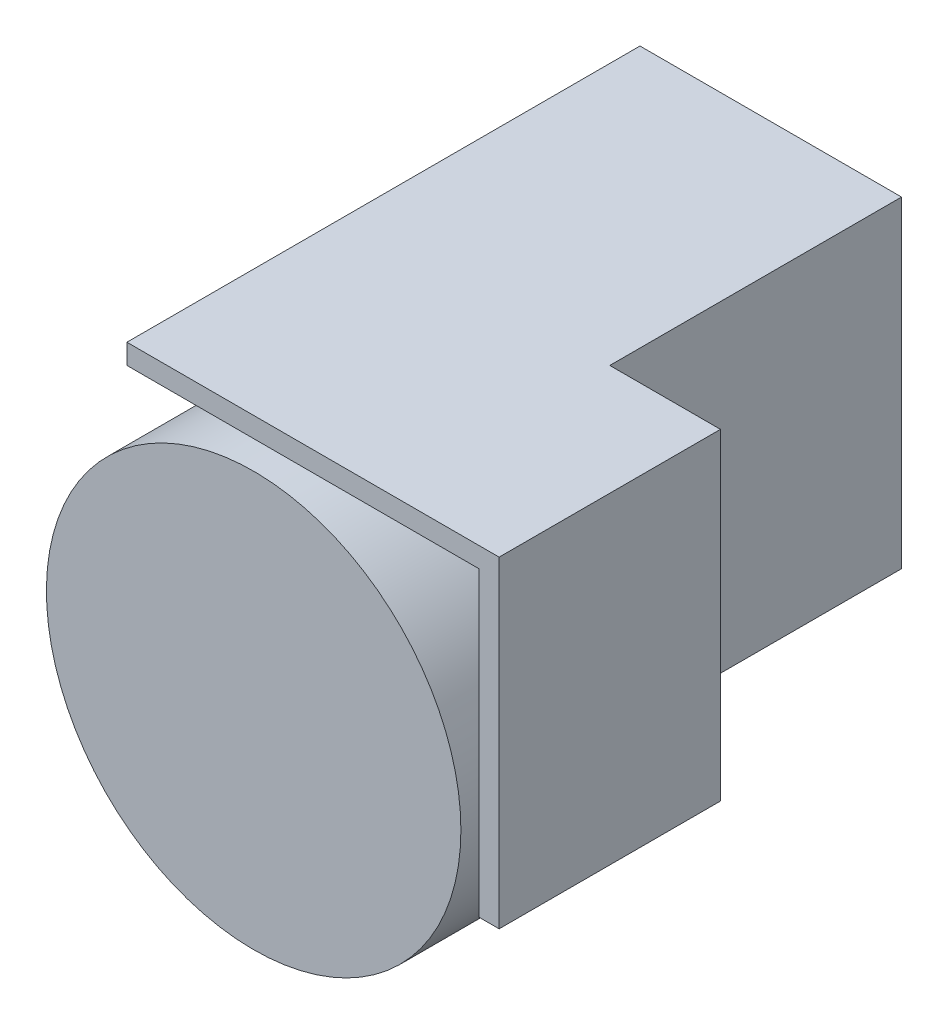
ISO-10303-21;
HEADER;
FILE_DESCRIPTION(('STEP AP214'),'2;1');
FILE_NAME('part.step','',(''),(''),'','','');
FILE_SCHEMA(('AUTOMOTIVE_DESIGN { 1 0 10303 214 1 1 1 1 }'));
ENDSEC;
DATA;
#1=APPLICATION_CONTEXT('core data for automotive mechanical design processes');
#2=APPLICATION_PROTOCOL_DEFINITION('international standard','automotive_design',2000,#1);
#3=PRODUCT_CONTEXT('',#1,'mechanical');
#4=PRODUCT('Part','Part','',(#3));
#5=PRODUCT_RELATED_PRODUCT_CATEGORY('part','',(#4));
#6=PRODUCT_DEFINITION_FORMATION('','',#4);
#7=PRODUCT_DEFINITION_CONTEXT('part definition',#1,'design');
#8=PRODUCT_DEFINITION('design','',#6,#7);
#9=PRODUCT_DEFINITION_SHAPE('','',#8);
#10=(LENGTH_UNIT() NAMED_UNIT(*) SI_UNIT(.MILLI.,.METRE.));
#11=(NAMED_UNIT(*) PLANE_ANGLE_UNIT() SI_UNIT($,.RADIAN.));
#12=(NAMED_UNIT(*) SI_UNIT($,.STERADIAN.) SOLID_ANGLE_UNIT());
#13=UNCERTAINTY_MEASURE_WITH_UNIT(LENGTH_MEASURE(1.E-05),#10,'distance_accuracy_value','');
#14=(GEOMETRIC_REPRESENTATION_CONTEXT(3) GLOBAL_UNCERTAINTY_ASSIGNED_CONTEXT((#13)) GLOBAL_UNIT_ASSIGNED_CONTEXT((#10,
#11,#12)) REPRESENTATION_CONTEXT('',''));
#15=CARTESIAN_POINT('',(0.,0.,0.));
#16=DIRECTION('',(0.,0.,1.));
#17=DIRECTION('',(1.,0.,0.));
#18=AXIS2_PLACEMENT_3D('',#15,#16,#17);
#19=CARTESIAN_POINT('',(-11.090622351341,0.,30.));
#20=DIRECTION('',(-1.,0.,0.));
#21=DIRECTION('',(0.,0.,1.));
#22=AXIS2_PLACEMENT_3D('',#19,#20,#21);
#23=PLANE('',#22);
#24=DIRECTION('',(0.,1.,0.));
#25=VECTOR('',#24,1.);
#26=CARTESIAN_POINT('',(-11.090622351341,0.,0.));
#27=LINE('',#26,#25);
#28=CARTESIAN_POINT('',(-11.090622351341,0.,0.));
#29=VERTEX_POINT('',#28);
#30=CARTESIAN_POINT('',(-11.090622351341,32.,0.));
#31=VERTEX_POINT('',#30);
#32=EDGE_CURVE('E191',#29,#31,#27,.T.);
#33=ORIENTED_EDGE('',*,*,#32,.F.);
#34=DIRECTION('',(0.,0.,-1.));
#35=VECTOR('',#34,1.);
#36=CARTESIAN_POINT('',(-11.090622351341,0.,30.));
#37=LINE('',#36,#35);
#38=CARTESIAN_POINT('',(-11.090622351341,0.,30.));
#39=VERTEX_POINT('',#38);
#40=EDGE_CURVE('E11',#39,#29,#37,.T.);
#41=ORIENTED_EDGE('',*,*,#40,.F.);
#42=DIRECTION('',(0.,1.,0.));
#43=VECTOR('',#42,1.);
#44=CARTESIAN_POINT('',(-11.090622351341,0.,30.));
#45=LINE('',#44,#43);
#46=CARTESIAN_POINT('',(-11.090622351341,22.9799874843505,30.));
#47=VERTEX_POINT('',#46);
#48=EDGE_CURVE('E192',#39,#47,#45,.T.);
#49=ORIENTED_EDGE('',*,*,#48,.T.);
#50=CARTESIAN_POINT('',(-11.090622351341,30.,30.));
#51=VERTEX_POINT('',#50);
#52=EDGE_CURVE('E195',#47,#51,#45,.T.);
#53=ORIENTED_EDGE('',*,*,#52,.T.);
#54=DIRECTION('',(0.,0.,-1.));
#55=VECTOR('',#54,1.);
#56=CARTESIAN_POINT('',(-11.090622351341,30.,51.));
#57=LINE('',#56,#55);
#58=CARTESIAN_POINT('',(-11.090622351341,30.,51.));
#59=VERTEX_POINT('',#58);
#60=EDGE_CURVE('E174',#59,#51,#57,.T.);
#61=ORIENTED_EDGE('',*,*,#60,.F.);
#62=DIRECTION('',(0.,1.,0.));
#63=VECTOR('',#62,1.);
#64=CARTESIAN_POINT('',(-11.090622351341,30.,51.));
#65=LINE('',#64,#63);
#66=CARTESIAN_POINT('',(-11.090622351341,32.,51.));
#67=VERTEX_POINT('',#66);
#68=EDGE_CURVE('E171',#59,#67,#65,.T.);
#69=ORIENTED_EDGE('',*,*,#68,.T.);
#70=DIRECTION('',(0.,0.,-1.));
#71=VECTOR('',#70,1.);
#72=CARTESIAN_POINT('',(-11.090622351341,32.,51.));
#73=LINE('',#72,#71);
#74=EDGE_CURVE('E178',#67,#31,#73,.T.);
#75=ORIENTED_EDGE('',*,*,#74,.T.);
#76=EDGE_LOOP('',(#33,#41,#49,#53,#61,#69,#75));
#77=FACE_BOUND('',#76,.T.);
#78=ADVANCED_FACE('F38',(#77),#23,.T.);
#79=CARTESIAN_POINT('',(-11.090622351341,0.,30.));
#80=DIRECTION('',(0.,1.,0.));
#81=DIRECTION('',(0.,0.,1.));
#82=AXIS2_PLACEMENT_3D('',#79,#80,#81);
#83=PLANE('',#82);
#84=DIRECTION('',(1.,0.,0.));
#85=VECTOR('',#84,1.);
#86=CARTESIAN_POINT('',(-11.090622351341,0.,0.));
#87=LINE('',#86,#85);
#88=CARTESIAN_POINT('',(14.909377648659,0.,0.));
#89=VERTEX_POINT('',#88);
#90=EDGE_CURVE('E207',#29,#89,#87,.T.);
#91=ORIENTED_EDGE('',*,*,#90,.T.);
#92=DIRECTION('',(0.,0.,-1.));
#93=VECTOR('',#92,1.);
#94=CARTESIAN_POINT('',(14.909377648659,0.,30.));
#95=LINE('',#94,#93);
#96=CARTESIAN_POINT('',(14.909377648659,0.,30.));
#97=VERTEX_POINT('',#96);
#98=EDGE_CURVE('E46',#97,#89,#95,.T.);
#99=ORIENTED_EDGE('',*,*,#98,.F.);
#100=DIRECTION('',(1.,0.,0.));
#101=VECTOR('',#100,1.);
#102=CARTESIAN_POINT('',(-11.090622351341,0.,30.));
#103=LINE('',#102,#101);
#104=EDGE_CURVE('E202',#39,#97,#103,.T.);
#105=ORIENTED_EDGE('',*,*,#104,.F.);
#106=ORIENTED_EDGE('',*,*,#40,.T.);
#107=EDGE_LOOP('',(#91,#99,#105,#106));
#108=FACE_BOUND('',#107,.T.);
#109=ADVANCED_FACE('F238',(#108),#83,.F.);
#110=CARTESIAN_POINT('',(14.909377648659,0.,30.));
#111=DIRECTION('',(-1.,0.,0.));
#112=DIRECTION('',(0.,-1.,0.));
#113=AXIS2_PLACEMENT_3D('',#110,#111,#112);
#114=PLANE('',#113);
#115=ORIENTED_EDGE('',*,*,#98,.T.);
#116=DIRECTION('',(0.,1.,0.));
#117=VECTOR('',#116,1.);
#118=CARTESIAN_POINT('',(14.909377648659,0.,0.));
#119=LINE('',#118,#117);
#120=CARTESIAN_POINT('',(14.909377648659,32.,0.));
#121=VERTEX_POINT('',#120);
#122=EDGE_CURVE('E54',#89,#121,#119,.T.);
#123=ORIENTED_EDGE('',*,*,#122,.T.);
#124=DIRECTION('',(0.,0.,1.));
#125=VECTOR('',#124,1.);
#126=CARTESIAN_POINT('',(14.909377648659,32.,0.));
#127=LINE('',#126,#125);
#128=CARTESIAN_POINT('',(14.9093776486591,32.,29.));
#129=VERTEX_POINT('',#128);
#130=EDGE_CURVE('E133',#121,#129,#127,.T.);
#131=ORIENTED_EDGE('',*,*,#130,.T.);
#132=DIRECTION('',(0.,1.,0.));
#133=VECTOR('',#132,1.);
#134=CARTESIAN_POINT('',(14.9093776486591,-13.6,29.));
#135=LINE('',#134,#133);
#136=CARTESIAN_POINT('',(14.9093776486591,30.,29.));
#137=VERTEX_POINT('',#136);
#138=EDGE_CURVE('E122',#137,#129,#135,.T.);
#139=ORIENTED_EDGE('',*,*,#138,.F.);
#140=DIRECTION('',(0.,0.,-1.));
#141=VECTOR('',#140,1.);
#142=CARTESIAN_POINT('',(14.909377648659,30.,30.));
#143=LINE('',#142,#141);
#144=CARTESIAN_POINT('',(14.909377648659,30.,30.));
#145=VERTEX_POINT('',#144);
#146=EDGE_CURVE('E41',#145,#137,#143,.T.);
#147=ORIENTED_EDGE('',*,*,#146,.F.);
#148=DIRECTION('',(0.,1.,0.));
#149=VECTOR('',#148,1.);
#150=CARTESIAN_POINT('',(14.909377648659,0.,30.));
#151=LINE('',#150,#149);
#152=CARTESIAN_POINT('',(14.909377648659,22.9799874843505,30.));
#153=VERTEX_POINT('',#152);
#154=EDGE_CURVE('E198',#153,#145,#151,.T.);
#155=ORIENTED_EDGE('',*,*,#154,.F.);
#156=EDGE_CURVE('E199',#97,#153,#151,.T.);
#157=ORIENTED_EDGE('',*,*,#156,.F.);
#158=EDGE_LOOP('',(#115,#123,#131,#139,#147,#155,#157));
#159=FACE_BOUND('',#158,.T.);
#160=ADVANCED_FACE('F134',(#159),#114,.F.);
#161=CARTESIAN_POINT('',(0.,0.,30.));
#162=DIRECTION('',(0.,0.,-1.));
#163=DIRECTION('',(-1.,0.,0.));
#164=AXIS2_PLACEMENT_3D('',#161,#162,#163);
#165=PLANE('',#164);
#166=CARTESIAN_POINT('',(1.90937764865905,7.,30.));
#167=DIRECTION('',(0.,0.,1.));
#168=DIRECTION('',(1.,0.,0.));
#169=AXIS2_PLACEMENT_3D('',#166,#167,#168);
#170=CIRCLE('',#169,20.6);
#171=EDGE_CURVE('E62',#153,#47,#170,.T.);
#172=ORIENTED_EDGE('',*,*,#171,.F.);
#173=ORIENTED_EDGE('',*,*,#154,.T.);
#174=DIRECTION('',(1.,0.,0.));
#175=VECTOR('',#174,1.);
#176=CARTESIAN_POINT('',(-11.090622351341,30.,30.));
#177=LINE('',#176,#175);
#178=EDGE_CURVE('E194',#51,#145,#177,.T.);
#179=ORIENTED_EDGE('',*,*,#178,.F.);
#180=ORIENTED_EDGE('',*,*,#52,.F.);
#181=EDGE_LOOP('',(#172,#173,#179,#180));
#182=FACE_BOUND('',#181,.T.);
#183=ADVANCED_FACE('F250',(#182),#165,.F.);
#184=CARTESIAN_POINT('',(0.,0.,0.));
#185=DIRECTION('',(0.,0.,-1.));
#186=DIRECTION('',(-1.,0.,0.));
#187=AXIS2_PLACEMENT_3D('',#184,#185,#186);
#188=PLANE('',#187);
#189=DIRECTION('',(1.,0.,0.));
#190=VECTOR('',#189,1.);
#191=CARTESIAN_POINT('',(-11.090622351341,32.,0.));
#192=LINE('',#191,#190);
#193=EDGE_CURVE('E157',#31,#121,#192,.T.);
#194=ORIENTED_EDGE('',*,*,#193,.T.);
#195=ORIENTED_EDGE('',*,*,#122,.F.);
#196=ORIENTED_EDGE('',*,*,#90,.F.);
#197=ORIENTED_EDGE('',*,*,#32,.T.);
#198=EDGE_LOOP('',(#194,#195,#196,#197));
#199=FACE_BOUND('',#198,.T.);
#200=ADVANCED_FACE('F249',(#199),#188,.T.);
#201=CARTESIAN_POINT('',(-11.090622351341,30.,51.));
#202=DIRECTION('',(0.,1.,0.));
#203=DIRECTION('',(0.,0.,1.));
#204=AXIS2_PLACEMENT_3D('',#201,#202,#203);
#205=PLANE('',#204);
#206=ORIENTED_EDGE('',*,*,#146,.T.);
#207=DIRECTION('',(1.,0.,0.));
#208=VECTOR('',#207,1.);
#209=CARTESIAN_POINT('',(-11.090622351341,30.,29.));
#210=LINE('',#209,#208);
#211=CARTESIAN_POINT('',(23.909377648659,30.,29.));
#212=VERTEX_POINT('',#211);
#213=EDGE_CURVE('E128',#137,#212,#210,.T.);
#214=ORIENTED_EDGE('',*,*,#213,.T.);
#215=DIRECTION('',(0.,0.,-1.));
#216=VECTOR('',#215,1.);
#217=CARTESIAN_POINT('',(23.909377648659,30.,51.));
#218=LINE('',#217,#216);
#219=CARTESIAN_POINT('',(23.909377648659,30.,51.));
#220=VERTEX_POINT('',#219);
#221=EDGE_CURVE('E188',#220,#212,#218,.T.);
#222=ORIENTED_EDGE('',*,*,#221,.F.);
#223=DIRECTION('',(1.,0.,0.));
#224=VECTOR('',#223,1.);
#225=CARTESIAN_POINT('',(-11.090622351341,30.,51.));
#226=LINE('',#225,#224);
#227=EDGE_CURVE('E159',#59,#220,#226,.T.);
#228=ORIENTED_EDGE('',*,*,#227,.F.);
#229=ORIENTED_EDGE('',*,*,#60,.T.);
#230=ORIENTED_EDGE('',*,*,#178,.T.);
#231=EDGE_LOOP('',(#206,#214,#222,#228,#229,#230));
#232=FACE_BOUND('',#231,.T.);
#233=ADVANCED_FACE('F211',(#232),#205,.F.);
#234=CARTESIAN_POINT('',(23.909377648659,30.,51.));
#235=DIRECTION('',(1.,0.,0.));
#236=DIRECTION('',(0.,0.,-1.));
#237=AXIS2_PLACEMENT_3D('',#234,#235,#236);
#238=PLANE('',#237);
#239=ORIENTED_EDGE('',*,*,#221,.T.);
#240=DIRECTION('',(0.,-1.,0.));
#241=VECTOR('',#240,1.);
#242=CARTESIAN_POINT('',(23.909377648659,30.,29.));
#243=LINE('',#242,#241);
#244=CARTESIAN_POINT('',(23.909377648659,0.,29.));
#245=VERTEX_POINT('',#244);
#246=EDGE_CURVE('E149',#212,#245,#243,.T.);
#247=ORIENTED_EDGE('',*,*,#246,.T.);
#248=DIRECTION('',(0.,0.,-1.));
#249=VECTOR('',#248,1.);
#250=CARTESIAN_POINT('',(23.909377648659,0.,51.));
#251=LINE('',#250,#249);
#252=CARTESIAN_POINT('',(23.909377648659,0.,51.));
#253=VERTEX_POINT('',#252);
#254=EDGE_CURVE('E185',#253,#245,#251,.T.);
#255=ORIENTED_EDGE('',*,*,#254,.F.);
#256=DIRECTION('',(0.,-1.,0.));
#257=VECTOR('',#256,1.);
#258=CARTESIAN_POINT('',(23.909377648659,30.,51.));
#259=LINE('',#258,#257);
#260=EDGE_CURVE('E162',#220,#253,#259,.T.);
#261=ORIENTED_EDGE('',*,*,#260,.F.);
#262=EDGE_LOOP('',(#239,#247,#255,#261));
#263=FACE_BOUND('',#262,.T.);
#264=ADVANCED_FACE('F261',(#263),#238,.F.);
#265=CARTESIAN_POINT('',(23.909377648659,0.,51.));
#266=DIRECTION('',(0.,1.,0.));
#267=DIRECTION('',(-1.,0.,0.));
#268=AXIS2_PLACEMENT_3D('',#265,#266,#267);
#269=PLANE('',#268);
#270=ORIENTED_EDGE('',*,*,#254,.T.);
#271=DIRECTION('',(1.,0.,0.));
#272=VECTOR('',#271,1.);
#273=CARTESIAN_POINT('',(23.909377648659,0.,29.));
#274=LINE('',#273,#272);
#275=CARTESIAN_POINT('',(25.909377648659,0.,29.));
#276=VERTEX_POINT('',#275);
#277=EDGE_CURVE('E145',#245,#276,#274,.T.);
#278=ORIENTED_EDGE('',*,*,#277,.T.);
#279=DIRECTION('',(0.,0.,-1.));
#280=VECTOR('',#279,1.);
#281=CARTESIAN_POINT('',(25.909377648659,0.,51.));
#282=LINE('',#281,#280);
#283=CARTESIAN_POINT('',(25.909377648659,0.,51.));
#284=VERTEX_POINT('',#283);
#285=EDGE_CURVE('E182',#284,#276,#282,.T.);
#286=ORIENTED_EDGE('',*,*,#285,.F.);
#287=DIRECTION('',(1.,0.,0.));
#288=VECTOR('',#287,1.);
#289=CARTESIAN_POINT('',(23.909377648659,0.,51.));
#290=LINE('',#289,#288);
#291=EDGE_CURVE('E164',#253,#284,#290,.T.);
#292=ORIENTED_EDGE('',*,*,#291,.F.);
#293=EDGE_LOOP('',(#270,#278,#286,#292));
#294=FACE_BOUND('',#293,.T.);
#295=ADVANCED_FACE('F264',(#294),#269,.F.);
#296=CARTESIAN_POINT('',(25.909377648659,32.,51.));
#297=DIRECTION('',(1.,0.,0.));
#298=DIRECTION('',(0.,1.,0.));
#299=AXIS2_PLACEMENT_3D('',#296,#297,#298);
#300=PLANE('',#299);
#301=DIRECTION('',(0.,1.,0.));
#302=VECTOR('',#301,1.);
#303=CARTESIAN_POINT('',(25.909377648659,-13.6,29.));
#304=LINE('',#303,#302);
#305=CARTESIAN_POINT('',(25.909377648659,32.,29.));
#306=VERTEX_POINT('',#305);
#307=EDGE_CURVE('E131',#276,#306,#304,.T.);
#308=ORIENTED_EDGE('',*,*,#307,.T.);
#309=DIRECTION('',(0.,0.,-1.));
#310=VECTOR('',#309,1.);
#311=CARTESIAN_POINT('',(25.909377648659,32.,51.));
#312=LINE('',#311,#310);
#313=CARTESIAN_POINT('',(25.909377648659,32.,51.));
#314=VERTEX_POINT('',#313);
#315=EDGE_CURVE('E142',#314,#306,#312,.T.);
#316=ORIENTED_EDGE('',*,*,#315,.F.);
#317=DIRECTION('',(0.,-1.,0.));
#318=VECTOR('',#317,1.);
#319=CARTESIAN_POINT('',(25.909377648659,32.,51.));
#320=LINE('',#319,#318);
#321=EDGE_CURVE('E166',#314,#284,#320,.T.);
#322=ORIENTED_EDGE('',*,*,#321,.T.);
#323=ORIENTED_EDGE('',*,*,#285,.T.);
#324=EDGE_LOOP('',(#308,#316,#322,#323));
#325=FACE_BOUND('',#324,.T.);
#326=ADVANCED_FACE('F268',(#325),#300,.T.);
#327=CARTESIAN_POINT('',(-11.090622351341,32.,51.));
#328=DIRECTION('',(0.,1.,0.));
#329=DIRECTION('',(0.,0.,1.));
#330=AXIS2_PLACEMENT_3D('',#327,#328,#329);
#331=PLANE('',#330);
#332=DIRECTION('',(1.,0.,0.));
#333=VECTOR('',#332,1.);
#334=CARTESIAN_POINT('',(25.909377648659,32.,29.));
#335=LINE('',#334,#333);
#336=EDGE_CURVE('E125',#129,#306,#335,.T.);
#337=ORIENTED_EDGE('',*,*,#336,.F.);
#338=ORIENTED_EDGE('',*,*,#130,.F.);
#339=ORIENTED_EDGE('',*,*,#193,.F.);
#340=ORIENTED_EDGE('',*,*,#74,.F.);
#341=DIRECTION('',(1.,0.,0.));
#342=VECTOR('',#341,1.);
#343=CARTESIAN_POINT('',(23.909377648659,32.,51.));
#344=LINE('',#343,#342);
#345=EDGE_CURVE('E169',#67,#314,#344,.T.);
#346=ORIENTED_EDGE('',*,*,#345,.T.);
#347=ORIENTED_EDGE('',*,*,#315,.T.);
#348=EDGE_LOOP('',(#337,#338,#339,#340,#346,#347));
#349=FACE_BOUND('',#348,.T.);
#350=ADVANCED_FACE('F140',(#349),#331,.T.);
#351=CARTESIAN_POINT('',(0.,0.,51.));
#352=DIRECTION('',(0.,0.,-1.));
#353=DIRECTION('',(-1.,0.,0.));
#354=AXIS2_PLACEMENT_3D('',#351,#352,#353);
#355=PLANE('',#354);
#356=ORIENTED_EDGE('',*,*,#227,.T.);
#357=ORIENTED_EDGE('',*,*,#260,.T.);
#358=ORIENTED_EDGE('',*,*,#291,.T.);
#359=ORIENTED_EDGE('',*,*,#321,.F.);
#360=ORIENTED_EDGE('',*,*,#345,.F.);
#361=ORIENTED_EDGE('',*,*,#68,.F.);
#362=EDGE_LOOP('',(#356,#357,#358,#359,#360,#361));
#363=FACE_BOUND('',#362,.T.);
#364=ADVANCED_FACE('F224',(#363),#355,.F.);
#365=CARTESIAN_POINT('',(1.90937764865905,7.,51.4));
#366=DIRECTION('',(0.,0.,-1.));
#367=DIRECTION('',(-1.,0.,0.));
#368=AXIS2_PLACEMENT_3D('',#365,#366,#367);
#369=CYLINDRICAL_SURFACE('',#368,20.6);
#370=CARTESIAN_POINT('',(1.90937764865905,7.,51.4));
#371=DIRECTION('',(0.,0.,1.));
#372=DIRECTION('',(1.,0.,0.));
#373=AXIS2_PLACEMENT_3D('',#370,#371,#372);
#374=CIRCLE('',#373,20.6);
#375=CARTESIAN_POINT('',(22.5093776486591,7.,51.4));
#376=VERTEX_POINT('',#375);
#377=EDGE_CURVE('E154',#376,#376,#374,.T.);
#378=ORIENTED_EDGE('',*,*,#377,.F.);
#379=EDGE_LOOP('',(#378));
#380=FACE_BOUND('',#379,.T.);
#381=ORIENTED_EDGE('',*,*,#171,.T.);
#382=EDGE_CURVE('E153',#47,#153,#170,.T.);
#383=ORIENTED_EDGE('',*,*,#382,.T.);
#384=EDGE_LOOP('',(#381,#383));
#385=FACE_BOUND('',#384,.T.);
#386=ADVANCED_FACE('F221',(#380,#385),#369,.T.);
#387=CARTESIAN_POINT('',(1.90937764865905,7.,51.4));
#388=DIRECTION('',(0.,0.,1.));
#389=DIRECTION('',(1.,0.,0.));
#390=AXIS2_PLACEMENT_3D('',#387,#388,#389);
#391=PLANE('',#390);
#392=ORIENTED_EDGE('',*,*,#377,.T.);
#393=EDGE_LOOP('',(#392));
#394=FACE_BOUND('',#393,.T.);
#395=ADVANCED_FACE('F223',(#394),#391,.T.);
#396=CARTESIAN_POINT('',(1.90937764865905,7.,30.));
#397=DIRECTION('',(0.,0.,1.));
#398=DIRECTION('',(1.,0.,0.));
#399=AXIS2_PLACEMENT_3D('',#396,#397,#398);
#400=PLANE('',#399);
#401=ORIENTED_EDGE('',*,*,#48,.F.);
#402=ORIENTED_EDGE('',*,*,#104,.T.);
#403=ORIENTED_EDGE('',*,*,#156,.T.);
#404=ORIENTED_EDGE('',*,*,#382,.F.);
#405=EDGE_LOOP('',(#401,#402,#403,#404));
#406=FACE_BOUND('',#405,.T.);
#407=ADVANCED_FACE('F218',(#406),#400,.F.);
#408=CARTESIAN_POINT('',(25.909377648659,-13.6,29.));
#409=DIRECTION('',(0.,0.,1.));
#410=DIRECTION('',(1.,0.,0.));
#411=AXIS2_PLACEMENT_3D('',#408,#409,#410);
#412=PLANE('',#411);
#413=ORIENTED_EDGE('',*,*,#138,.T.);
#414=ORIENTED_EDGE('',*,*,#336,.T.);
#415=ORIENTED_EDGE('',*,*,#307,.F.);
#416=ORIENTED_EDGE('',*,*,#277,.F.);
#417=ORIENTED_EDGE('',*,*,#246,.F.);
#418=ORIENTED_EDGE('',*,*,#213,.F.);
#419=EDGE_LOOP('',(#413,#414,#415,#416,#417,#418));
#420=FACE_BOUND('',#419,.T.);
#421=ADVANCED_FACE('F123',(#420),#412,.F.);
#422=CLOSED_SHELL('',(#78,#109,#160,#183,#200,#233,#264,#295,#326,#350,#364,#386,#395,#407,#421));
#423=MANIFOLD_SOLID_BREP('B2',#422);
#424=ADVANCED_BREP_SHAPE_REPRESENTATION('',(#18,#423),#14);
#425=SHAPE_DEFINITION_REPRESENTATION(#9,#424);
ENDSEC;
END-ISO-10303-21;
